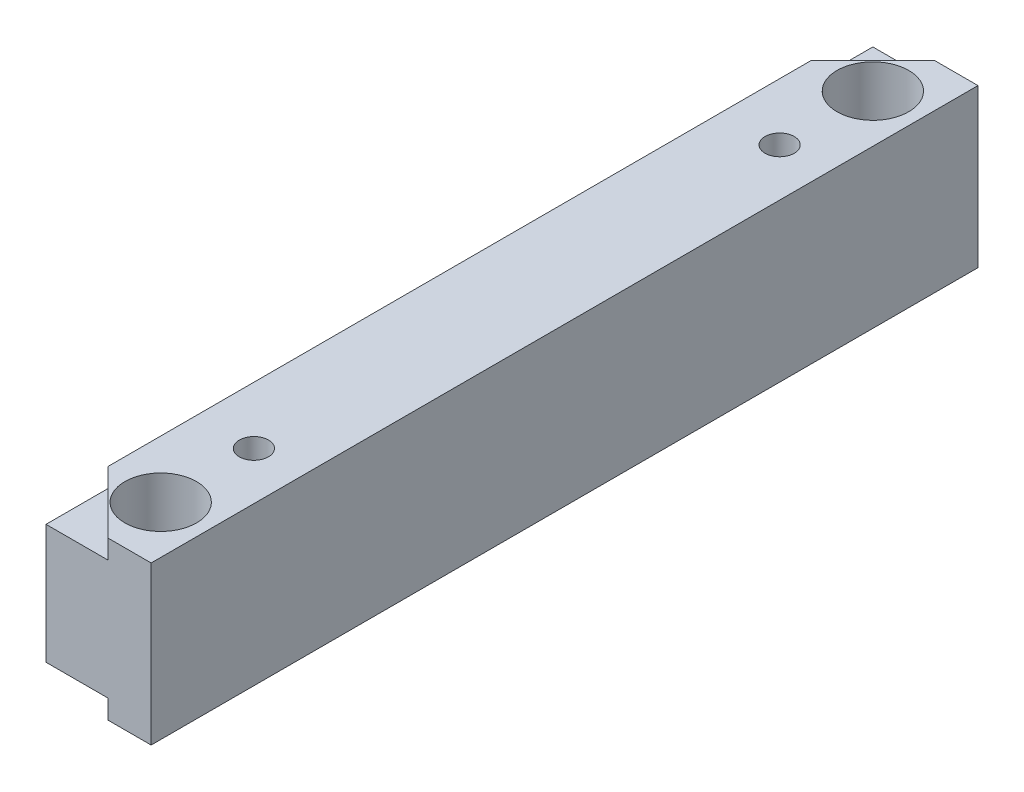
ISO-10303-21;
HEADER;
FILE_DESCRIPTION(('STEP AP214'),'2;1');
FILE_NAME('part.step','',(''),(''),'','','');
FILE_SCHEMA(('AUTOMOTIVE_DESIGN { 1 0 10303 214 1 1 1 1 }'));
ENDSEC;
DATA;
#1=APPLICATION_CONTEXT('core data for automotive mechanical design processes');
#2=APPLICATION_PROTOCOL_DEFINITION('international standard','automotive_design',2000,#1);
#3=PRODUCT_CONTEXT('',#1,'mechanical');
#4=PRODUCT('Part','Part','',(#3));
#5=PRODUCT_RELATED_PRODUCT_CATEGORY('part','',(#4));
#6=PRODUCT_DEFINITION_FORMATION('','',#4);
#7=PRODUCT_DEFINITION_CONTEXT('part definition',#1,'design');
#8=PRODUCT_DEFINITION('design','',#6,#7);
#9=PRODUCT_DEFINITION_SHAPE('','',#8);
#10=(LENGTH_UNIT() NAMED_UNIT(*) SI_UNIT(.MILLI.,.METRE.));
#11=(NAMED_UNIT(*) PLANE_ANGLE_UNIT() SI_UNIT($,.RADIAN.));
#12=(NAMED_UNIT(*) SI_UNIT($,.STERADIAN.) SOLID_ANGLE_UNIT());
#13=UNCERTAINTY_MEASURE_WITH_UNIT(LENGTH_MEASURE(1.E-05),#10,'distance_accuracy_value','');
#14=(GEOMETRIC_REPRESENTATION_CONTEXT(3) GLOBAL_UNCERTAINTY_ASSIGNED_CONTEXT((#13)) GLOBAL_UNIT_ASSIGNED_CONTEXT((#10,
#11,#12)) REPRESENTATION_CONTEXT('',''));
#15=CARTESIAN_POINT('',(0.,0.,0.));
#16=DIRECTION('',(0.,0.,1.));
#17=DIRECTION('',(1.,0.,0.));
#18=AXIS2_PLACEMENT_3D('',#15,#16,#17);
#19=CARTESIAN_POINT('',(-96.844,-74.,-81.844));
#20=DIRECTION('',(0.,1.,0.));
#21=DIRECTION('',(0.,0.,-1.));
#22=AXIS2_PLACEMENT_3D('',#19,#20,#21);
#23=PLANE('',#22);
#24=DIRECTION('',(0.,0.,-1.));
#25=VECTOR('',#24,1.);
#26=CARTESIAN_POINT('',(-123.,-73.999999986,65.));
#27=LINE('',#26,#25);
#28=CARTESIAN_POINT('',(-123.,-73.9999999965,-81.99999997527));
#29=VERTEX_POINT('',#28);
#30=CARTESIAN_POINT('',(-123.,-73.999999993,-108.));
#31=VERTEX_POINT('',#30);
#32=EDGE_CURVE('E136',#29,#31,#27,.T.);
#33=ORIENTED_EDGE('',*,*,#32,.F.);
#34=DIRECTION('',(-0.707106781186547,0.,0.707106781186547));
#35=VECTOR('',#34,1.);
#36=CARTESIAN_POINT('',(-110.,-74.,-95.));
#37=LINE('',#36,#35);
#38=CARTESIAN_POINT('',(-97.00000000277,-73.9999999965,-108.));
#39=VERTEX_POINT('',#38);
#40=EDGE_CURVE('E123',#39,#29,#37,.T.);
#41=ORIENTED_EDGE('',*,*,#40,.F.);
#42=DIRECTION('',(1.,0.,0.));
#43=VECTOR('',#42,1.);
#44=CARTESIAN_POINT('',(-101.,-73.999999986,-108.));
#45=LINE('',#44,#43);
#46=EDGE_CURVE('E143',#31,#39,#45,.T.);
#47=ORIENTED_EDGE('',*,*,#46,.F.);
#48=EDGE_LOOP('',(#33,#41,#47));
#49=FACE_BOUND('',#48,.T.);
#50=ADVANCED_FACE('F24',(#49),#23,.T.);
#51=CARTESIAN_POINT('',(-96.844,-124.,-81.844));
#52=DIRECTION('',(0.,1.,0.));
#53=DIRECTION('',(0.,0.,-1.));
#54=AXIS2_PLACEMENT_3D('',#51,#52,#53);
#55=PLANE('',#54);
#56=DIRECTION('',(0.707106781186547,0.,-0.707106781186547));
#57=VECTOR('',#56,1.);
#58=CARTESIAN_POINT('',(-110.,-124.,-95.));
#59=LINE('',#58,#57);
#60=CARTESIAN_POINT('',(-123.,-124.000000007,-81.999999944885));
#61=VERTEX_POINT('',#60);
#62=CARTESIAN_POINT('',(-97.000000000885,-124.0000000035,-108.));
#63=VERTEX_POINT('',#62);
#64=EDGE_CURVE('E182',#61,#63,#59,.T.);
#65=ORIENTED_EDGE('',*,*,#64,.F.);
#66=DIRECTION('',(0.,0.,1.));
#67=VECTOR('',#66,1.);
#68=CARTESIAN_POINT('',(-123.,-124.000000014,65.));
#69=LINE('',#68,#67);
#70=CARTESIAN_POINT('',(-123.,-124.000000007,-108.));
#71=VERTEX_POINT('',#70);
#72=EDGE_CURVE('E144',#71,#61,#69,.T.);
#73=ORIENTED_EDGE('',*,*,#72,.F.);
#74=DIRECTION('',(-1.,0.,0.));
#75=VECTOR('',#74,1.);
#76=CARTESIAN_POINT('',(-101.,-124.000000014,-108.));
#77=LINE('',#76,#75);
#78=EDGE_CURVE('E185',#63,#71,#77,.T.);
#79=ORIENTED_EDGE('',*,*,#78,.F.);
#80=EDGE_LOOP('',(#65,#73,#79));
#81=FACE_BOUND('',#80,.T.);
#82=ADVANCED_FACE('F291',(#81),#55,.F.);
#83=CARTESIAN_POINT('',(-123.,-74.,211.844));
#84=DIRECTION('',(0.,1.,0.));
#85=DIRECTION('',(0.,0.,1.));
#86=AXIS2_PLACEMENT_3D('',#83,#84,#85);
#87=PLANE('',#86);
#88=DIRECTION('',(0.707106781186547,0.,0.707106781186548));
#89=VECTOR('',#88,1.);
#90=CARTESIAN_POINT('',(-110.,-74.,225.));
#91=LINE('',#90,#89);
#92=CARTESIAN_POINT('',(-123.,-73.9999999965,211.99999997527));
#93=VERTEX_POINT('',#92);
#94=CARTESIAN_POINT('',(-97.000000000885,-73.9999999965,238.));
#95=VERTEX_POINT('',#94);
#96=EDGE_CURVE('E132',#93,#95,#91,.T.);
#97=ORIENTED_EDGE('',*,*,#96,.F.);
#98=DIRECTION('',(0.,0.,-1.));
#99=VECTOR('',#98,1.);
#100=CARTESIAN_POINT('',(-123.,-73.999999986,65.));
#101=LINE('',#100,#99);
#102=CARTESIAN_POINT('',(-123.,-73.999999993,238.));
#103=VERTEX_POINT('',#102);
#104=EDGE_CURVE('E117',#103,#93,#101,.T.);
#105=ORIENTED_EDGE('',*,*,#104,.F.);
#106=DIRECTION('',(-1.,0.,0.));
#107=VECTOR('',#106,1.);
#108=CARTESIAN_POINT('',(-101.,-73.999999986,238.));
#109=LINE('',#108,#107);
#110=EDGE_CURVE('E163',#95,#103,#109,.T.);
#111=ORIENTED_EDGE('',*,*,#110,.F.);
#112=EDGE_LOOP('',(#97,#105,#111));
#113=FACE_BOUND('',#112,.T.);
#114=ADVANCED_FACE('F294',(#113),#87,.T.);
#115=CARTESIAN_POINT('',(-123.,-124.,211.844));
#116=DIRECTION('',(0.,1.,0.));
#117=DIRECTION('',(0.,0.,1.));
#118=AXIS2_PLACEMENT_3D('',#115,#116,#117);
#119=PLANE('',#118);
#120=DIRECTION('',(0.,0.,1.));
#121=VECTOR('',#120,1.);
#122=CARTESIAN_POINT('',(-123.,-124.000000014,65.));
#123=LINE('',#122,#121);
#124=CARTESIAN_POINT('',(-123.,-124.0000000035,211.99999997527));
#125=VERTEX_POINT('',#124);
#126=CARTESIAN_POINT('',(-123.,-124.000000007,238.));
#127=VERTEX_POINT('',#126);
#128=EDGE_CURVE('E146',#125,#127,#123,.T.);
#129=ORIENTED_EDGE('',*,*,#128,.F.);
#130=DIRECTION('',(-0.707106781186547,0.,-0.707106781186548));
#131=VECTOR('',#130,1.);
#132=CARTESIAN_POINT('',(-110.,-124.,225.));
#133=LINE('',#132,#131);
#134=CARTESIAN_POINT('',(-96.999999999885,-124.000000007,238.));
#135=VERTEX_POINT('',#134);
#136=EDGE_CURVE('E83',#135,#125,#133,.T.);
#137=ORIENTED_EDGE('',*,*,#136,.F.);
#138=DIRECTION('',(1.,0.,0.));
#139=VECTOR('',#138,1.);
#140=CARTESIAN_POINT('',(-101.,-124.000000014,238.));
#141=LINE('',#140,#139);
#142=EDGE_CURVE('E225',#127,#135,#141,.T.);
#143=ORIENTED_EDGE('',*,*,#142,.F.);
#144=EDGE_LOOP('',(#129,#137,#143));
#145=FACE_BOUND('',#144,.T.);
#146=ADVANCED_FACE('F244',(#145),#119,.F.);
#147=CARTESIAN_POINT('',(-97.,-74.,-108.));
#148=DIRECTION('',(-0.707106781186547,0.,-0.707106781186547));
#149=DIRECTION('',(-0.707106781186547,0.,0.707106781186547));
#150=AXIS2_PLACEMENT_3D('',#147,#148,#149);
#151=PLANE('',#150);
#152=DIRECTION('',(-0.707106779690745,0.,0.70710678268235));
#153=VECTOR('',#152,1.);
#154=CARTESIAN_POINT('',(-96.999999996,-66.,-108.));
#155=LINE('',#154,#153);
#156=CARTESIAN_POINT('',(-96.999999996,-66.,-108.));
#157=VERTEX_POINT('',#156);
#158=CARTESIAN_POINT('',(-123.,-66.,-81.999999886));
#159=VERTEX_POINT('',#158);
#160=EDGE_CURVE('E28',#157,#159,#155,.T.);
#161=ORIENTED_EDGE('',*,*,#160,.F.);
#162=DIRECTION('',(0.,1.,0.));
#163=VECTOR('',#162,1.);
#164=CARTESIAN_POINT('',(-96.999999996,-99.,-108.));
#165=LINE('',#164,#163);
#166=EDGE_CURVE('E74',#39,#157,#165,.T.);
#167=ORIENTED_EDGE('',*,*,#166,.F.);
#168=ORIENTED_EDGE('',*,*,#40,.T.);
#169=DIRECTION('',(0.,-1.,0.));
#170=VECTOR('',#169,1.);
#171=CARTESIAN_POINT('',(-123.,-99.,-81.999999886));
#172=LINE('',#171,#170);
#173=EDGE_CURVE('E127',#159,#29,#172,.T.);
#174=ORIENTED_EDGE('',*,*,#173,.F.);
#175=EDGE_LOOP('',(#161,#167,#168,#174));
#176=FACE_BOUND('',#175,.T.);
#177=ADVANCED_FACE('F126',(#176),#151,.T.);
#178=CARTESIAN_POINT('',(-97.,-66.,238.));
#179=DIRECTION('',(-0.707106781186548,0.,0.707106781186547));
#180=DIRECTION('',(-0.707106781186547,0.,-0.707106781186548));
#181=AXIS2_PLACEMENT_3D('',#178,#179,#180);
#182=PLANE('',#181);
#183=DIRECTION('',(0.707106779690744,0.,0.707106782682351));
#184=VECTOR('',#183,1.);
#185=CARTESIAN_POINT('',(-123.,-66.,211.999999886));
#186=LINE('',#185,#184);
#187=CARTESIAN_POINT('',(-123.,-66.,211.999999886));
#188=VERTEX_POINT('',#187);
#189=CARTESIAN_POINT('',(-96.999999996,-66.,238.));
#190=VERTEX_POINT('',#189);
#191=EDGE_CURVE('E158',#188,#190,#186,.T.);
#192=ORIENTED_EDGE('',*,*,#191,.F.);
#193=DIRECTION('',(0.,1.,0.));
#194=VECTOR('',#193,1.);
#195=CARTESIAN_POINT('',(-123.,-99.,211.999999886));
#196=LINE('',#195,#194);
#197=EDGE_CURVE('E141',#93,#188,#196,.T.);
#198=ORIENTED_EDGE('',*,*,#197,.F.);
#199=ORIENTED_EDGE('',*,*,#96,.T.);
#200=DIRECTION('',(0.,-1.,0.));
#201=VECTOR('',#200,1.);
#202=CARTESIAN_POINT('',(-96.999999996,-99.,238.));
#203=LINE('',#202,#201);
#204=EDGE_CURVE('E160',#190,#95,#203,.T.);
#205=ORIENTED_EDGE('',*,*,#204,.F.);
#206=EDGE_LOOP('',(#192,#198,#199,#205));
#207=FACE_BOUND('',#206,.T.);
#208=ADVANCED_FACE('F217',(#207),#182,.T.);
#209=CARTESIAN_POINT('',(-123.,-132.,238.));
#210=DIRECTION('',(-1.,0.,0.));
#211=DIRECTION('',(0.,1.,0.));
#212=AXIS2_PLACEMENT_3D('',#209,#210,#211);
#213=PLANE('',#212);
#214=DIRECTION('',(0.,0.,1.));
#215=VECTOR('',#214,1.);
#216=CARTESIAN_POINT('',(-123.,-66.,65.));
#217=LINE('',#216,#215);
#218=EDGE_CURVE('E139',#159,#188,#217,.T.);
#219=ORIENTED_EDGE('',*,*,#218,.F.);
#220=ORIENTED_EDGE('',*,*,#173,.T.);
#221=ORIENTED_EDGE('',*,*,#32,.T.);
#222=DIRECTION('',(0.,1.,0.));
#223=VECTOR('',#222,1.);
#224=CARTESIAN_POINT('',(-123.,-99.,-108.));
#225=LINE('',#224,#223);
#226=EDGE_CURVE('E234',#71,#31,#225,.T.);
#227=ORIENTED_EDGE('',*,*,#226,.F.);
#228=ORIENTED_EDGE('',*,*,#72,.T.);
#229=DIRECTION('',(0.,1.,0.));
#230=VECTOR('',#229,1.);
#231=CARTESIAN_POINT('',(-123.,-128.,-82.));
#232=LINE('',#231,#230);
#233=CARTESIAN_POINT('',(-123.,-132.,-81.999999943));
#234=VERTEX_POINT('',#233);
#235=EDGE_CURVE('E140',#234,#61,#232,.T.);
#236=ORIENTED_EDGE('',*,*,#235,.F.);
#237=DIRECTION('',(0.,0.,-1.));
#238=VECTOR('',#237,1.);
#239=CARTESIAN_POINT('',(-123.,-132.,65.));
#240=LINE('',#239,#238);
#241=CARTESIAN_POINT('',(-123.,-132.,211.999999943));
#242=VERTEX_POINT('',#241);
#243=EDGE_CURVE('E176',#242,#234,#240,.T.);
#244=ORIENTED_EDGE('',*,*,#243,.F.);
#245=DIRECTION('',(0.,-1.,0.));
#246=VECTOR('',#245,1.);
#247=CARTESIAN_POINT('',(-123.,-128.,212.));
#248=LINE('',#247,#246);
#249=EDGE_CURVE('E174',#125,#242,#248,.T.);
#250=ORIENTED_EDGE('',*,*,#249,.F.);
#251=ORIENTED_EDGE('',*,*,#128,.T.);
#252=DIRECTION('',(0.,-1.,0.));
#253=VECTOR('',#252,1.);
#254=CARTESIAN_POINT('',(-123.,-99.,238.));
#255=LINE('',#254,#253);
#256=EDGE_CURVE('E173',#103,#127,#255,.T.);
#257=ORIENTED_EDGE('',*,*,#256,.F.);
#258=ORIENTED_EDGE('',*,*,#104,.T.);
#259=ORIENTED_EDGE('',*,*,#197,.T.);
#260=EDGE_LOOP('',(#219,#220,#221,#227,#228,#236,#244,#250,#251,#257,#258,#259));
#261=FACE_BOUND('',#260,.T.);
#262=ADVANCED_FACE('F134',(#261),#213,.T.);
#263=CARTESIAN_POINT('',(-97.,-132.,-108.));
#264=DIRECTION('',(-0.707106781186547,0.,-0.707106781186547));
#265=DIRECTION('',(-0.707106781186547,0.,0.707106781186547));
#266=AXIS2_PLACEMENT_3D('',#263,#264,#265);
#267=PLANE('',#266);
#268=ORIENTED_EDGE('',*,*,#64,.T.);
#269=DIRECTION('',(0.,1.,0.));
#270=VECTOR('',#269,1.);
#271=CARTESIAN_POINT('',(-96.999999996,-99.,-108.));
#272=LINE('',#271,#270);
#273=CARTESIAN_POINT('',(-96.999999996,-132.,-108.));
#274=VERTEX_POINT('',#273);
#275=EDGE_CURVE('E152',#274,#63,#272,.T.);
#276=ORIENTED_EDGE('',*,*,#275,.F.);
#277=DIRECTION('',(0.707106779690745,0.,-0.70710678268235));
#278=VECTOR('',#277,1.);
#279=CARTESIAN_POINT('',(-123.,-132.,-81.999999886));
#280=LINE('',#279,#278);
#281=EDGE_CURVE('E178',#234,#274,#280,.T.);
#282=ORIENTED_EDGE('',*,*,#281,.F.);
#283=ORIENTED_EDGE('',*,*,#235,.T.);
#284=EDGE_LOOP('',(#268,#276,#282,#283));
#285=FACE_BOUND('',#284,.T.);
#286=ADVANCED_FACE('F256',(#285),#267,.T.);
#287=CARTESIAN_POINT('',(-123.,-132.,-108.));
#288=DIRECTION('',(0.,0.,-1.));
#289=DIRECTION('',(0.,1.,0.));
#290=AXIS2_PLACEMENT_3D('',#287,#288,#289);
#291=PLANE('',#290);
#292=ORIENTED_EDGE('',*,*,#78,.T.);
#293=ORIENTED_EDGE('',*,*,#226,.T.);
#294=ORIENTED_EDGE('',*,*,#46,.T.);
#295=ORIENTED_EDGE('',*,*,#166,.T.);
#296=DIRECTION('',(-1.,0.,0.));
#297=VECTOR('',#296,1.);
#298=CARTESIAN_POINT('',(-101.,-66.,-108.));
#299=LINE('',#298,#297);
#300=CARTESIAN_POINT('',(-79.,-66.,-108.));
#301=VERTEX_POINT('',#300);
#302=EDGE_CURVE('E153',#301,#157,#299,.T.);
#303=ORIENTED_EDGE('',*,*,#302,.F.);
#304=DIRECTION('',(0.,1.,0.));
#305=VECTOR('',#304,1.);
#306=CARTESIAN_POINT('',(-79.,-99.,-108.));
#307=LINE('',#306,#305);
#308=CARTESIAN_POINT('',(-79.,-132.,-108.));
#309=VERTEX_POINT('',#308);
#310=EDGE_CURVE('E227',#309,#301,#307,.T.);
#311=ORIENTED_EDGE('',*,*,#310,.F.);
#312=DIRECTION('',(1.,0.,0.));
#313=VECTOR('',#312,1.);
#314=CARTESIAN_POINT('',(-101.,-132.,-108.));
#315=LINE('',#314,#313);
#316=EDGE_CURVE('E186',#274,#309,#315,.T.);
#317=ORIENTED_EDGE('',*,*,#316,.F.);
#318=ORIENTED_EDGE('',*,*,#275,.T.);
#319=EDGE_LOOP('',(#292,#293,#294,#295,#303,#311,#317,#318));
#320=FACE_BOUND('',#319,.T.);
#321=ADVANCED_FACE('F252',(#320),#291,.T.);
#322=CARTESIAN_POINT('',(-79.,-66.,238.));
#323=DIRECTION('',(1.,0.,0.));
#324=DIRECTION('',(0.,-1.,0.));
#325=AXIS2_PLACEMENT_3D('',#322,#323,#324);
#326=PLANE('',#325);
#327=DIRECTION('',(0.,0.,1.));
#328=VECTOR('',#327,1.);
#329=CARTESIAN_POINT('',(-79.,-132.,65.));
#330=LINE('',#329,#328);
#331=CARTESIAN_POINT('',(-79.,-132.,238.));
#332=VERTEX_POINT('',#331);
#333=EDGE_CURVE('E170',#309,#332,#330,.T.);
#334=ORIENTED_EDGE('',*,*,#333,.F.);
#335=ORIENTED_EDGE('',*,*,#310,.T.);
#336=DIRECTION('',(0.,0.,-1.));
#337=VECTOR('',#336,1.);
#338=CARTESIAN_POINT('',(-79.,-66.,65.));
#339=LINE('',#338,#337);
#340=CARTESIAN_POINT('',(-79.,-66.,238.));
#341=VERTEX_POINT('',#340);
#342=EDGE_CURVE('E155',#341,#301,#339,.T.);
#343=ORIENTED_EDGE('',*,*,#342,.F.);
#344=DIRECTION('',(0.,1.,0.));
#345=VECTOR('',#344,1.);
#346=CARTESIAN_POINT('',(-79.,-99.,238.));
#347=LINE('',#346,#345);
#348=EDGE_CURVE('E164',#332,#341,#347,.T.);
#349=ORIENTED_EDGE('',*,*,#348,.F.);
#350=EDGE_LOOP('',(#334,#335,#343,#349));
#351=FACE_BOUND('',#350,.T.);
#352=ADVANCED_FACE('F250',(#351),#326,.T.);
#353=CARTESIAN_POINT('',(-123.,-66.,238.));
#354=DIRECTION('',(0.,0.,1.));
#355=DIRECTION('',(0.,-1.,0.));
#356=AXIS2_PLACEMENT_3D('',#353,#354,#355);
#357=PLANE('',#356);
#358=ORIENTED_EDGE('',*,*,#110,.T.);
#359=ORIENTED_EDGE('',*,*,#256,.T.);
#360=ORIENTED_EDGE('',*,*,#142,.T.);
#361=DIRECTION('',(0.,1.,0.));
#362=VECTOR('',#361,1.);
#363=CARTESIAN_POINT('',(-97.,-128.,238.));
#364=LINE('',#363,#362);
#365=CARTESIAN_POINT('',(-96.999999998,-132.,238.));
#366=VERTEX_POINT('',#365);
#367=EDGE_CURVE('E171',#366,#135,#364,.T.);
#368=ORIENTED_EDGE('',*,*,#367,.F.);
#369=DIRECTION('',(-1.,0.,0.));
#370=VECTOR('',#369,1.);
#371=CARTESIAN_POINT('',(-101.,-132.,238.));
#372=LINE('',#371,#370);
#373=EDGE_CURVE('E43',#332,#366,#372,.T.);
#374=ORIENTED_EDGE('',*,*,#373,.F.);
#375=ORIENTED_EDGE('',*,*,#348,.T.);
#376=DIRECTION('',(1.,0.,0.));
#377=VECTOR('',#376,1.);
#378=CARTESIAN_POINT('',(-101.,-66.,238.));
#379=LINE('',#378,#377);
#380=EDGE_CURVE('E165',#190,#341,#379,.T.);
#381=ORIENTED_EDGE('',*,*,#380,.F.);
#382=ORIENTED_EDGE('',*,*,#204,.T.);
#383=EDGE_LOOP('',(#358,#359,#360,#368,#374,#375,#381,#382));
#384=FACE_BOUND('',#383,.T.);
#385=ADVANCED_FACE('F221',(#384),#357,.T.);
#386=CARTESIAN_POINT('',(-97.,-124.,238.));
#387=DIRECTION('',(-0.707106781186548,0.,0.707106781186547));
#388=DIRECTION('',(-0.707106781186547,0.,-0.707106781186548));
#389=AXIS2_PLACEMENT_3D('',#386,#387,#388);
#390=PLANE('',#389);
#391=ORIENTED_EDGE('',*,*,#136,.T.);
#392=ORIENTED_EDGE('',*,*,#249,.T.);
#393=DIRECTION('',(-0.707106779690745,0.,-0.70710678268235));
#394=VECTOR('',#393,1.);
#395=CARTESIAN_POINT('',(-96.999999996,-132.,238.));
#396=LINE('',#395,#394);
#397=EDGE_CURVE('E169',#366,#242,#396,.T.);
#398=ORIENTED_EDGE('',*,*,#397,.F.);
#399=ORIENTED_EDGE('',*,*,#367,.T.);
#400=EDGE_LOOP('',(#391,#392,#398,#399));
#401=FACE_BOUND('',#400,.T.);
#402=ADVANCED_FACE('F287',(#401),#390,.T.);
#403=CARTESIAN_POINT('',(-99.,-132.,214.));
#404=DIRECTION('',(0.,1.,0.));
#405=DIRECTION('',(0.,0.,1.));
#406=AXIS2_PLACEMENT_3D('',#403,#404,#405);
#407=CYLINDRICAL_SURFACE('',#406,15.);
#408=CARTESIAN_POINT('',(-99.,-132.,214.));
#409=DIRECTION('',(0.,1.,0.));
#410=DIRECTION('',(0.,0.,1.));
#411=AXIS2_PLACEMENT_3D('',#408,#409,#410);
#412=CIRCLE('',#411,15.);
#413=CARTESIAN_POINT('',(-99.,-132.,229.));
#414=VERTEX_POINT('',#413);
#415=EDGE_CURVE('E197',#414,#414,#412,.T.);
#416=ORIENTED_EDGE('',*,*,#415,.F.);
#417=EDGE_LOOP('',(#416));
#418=FACE_BOUND('',#417,.T.);
#419=CARTESIAN_POINT('',(-99.,-66.,214.));
#420=DIRECTION('',(0.,1.,0.));
#421=DIRECTION('',(0.,0.,1.));
#422=AXIS2_PLACEMENT_3D('',#419,#420,#421);
#423=CIRCLE('',#422,15.);
#424=CARTESIAN_POINT('',(-99.,-66.,229.));
#425=VERTEX_POINT('',#424);
#426=EDGE_CURVE('E154',#425,#425,#423,.F.);
#427=ORIENTED_EDGE('',*,*,#426,.F.);
#428=EDGE_LOOP('',(#427));
#429=FACE_BOUND('',#428,.T.);
#430=ADVANCED_FACE('F283',(#418,#429),#407,.F.);
#431=CARTESIAN_POINT('',(-99.,-66.,-45.));
#432=DIRECTION('',(0.,-1.,0.));
#433=DIRECTION('',(0.,0.,-1.));
#434=AXIS2_PLACEMENT_3D('',#431,#432,#433);
#435=CYLINDRICAL_SURFACE('',#434,6.09999999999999);
#436=CARTESIAN_POINT('',(-99.,-132.,-45.));
#437=DIRECTION('',(0.,-1.,0.));
#438=DIRECTION('',(0.,0.,-1.));
#439=AXIS2_PLACEMENT_3D('',#436,#437,#438);
#440=CIRCLE('',#439,6.09999999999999);
#441=CARTESIAN_POINT('',(-99.,-132.,-51.1));
#442=VERTEX_POINT('',#441);
#443=EDGE_CURVE('E194',#442,#442,#440,.F.);
#444=ORIENTED_EDGE('',*,*,#443,.F.);
#445=EDGE_LOOP('',(#444));
#446=FACE_BOUND('',#445,.T.);
#447=CARTESIAN_POINT('',(-99.,-66.,-45.));
#448=DIRECTION('',(0.,-1.,0.));
#449=DIRECTION('',(0.,0.,-1.));
#450=AXIS2_PLACEMENT_3D('',#447,#448,#449);
#451=CIRCLE('',#450,6.09999999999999);
#452=CARTESIAN_POINT('',(-99.,-66.,-51.1));
#453=VERTEX_POINT('',#452);
#454=EDGE_CURVE('E204',#453,#453,#451,.T.);
#455=ORIENTED_EDGE('',*,*,#454,.F.);
#456=EDGE_LOOP('',(#455));
#457=FACE_BOUND('',#456,.T.);
#458=ADVANCED_FACE('F279',(#446,#457),#435,.F.);
#459=CARTESIAN_POINT('',(-99.,-132.,-84.));
#460=DIRECTION('',(0.,1.,0.));
#461=DIRECTION('',(0.,0.,1.));
#462=AXIS2_PLACEMENT_3D('',#459,#460,#461);
#463=CYLINDRICAL_SURFACE('',#462,15.);
#464=CARTESIAN_POINT('',(-99.,-132.,-84.));
#465=DIRECTION('',(0.,1.,0.));
#466=DIRECTION('',(0.,0.,1.));
#467=AXIS2_PLACEMENT_3D('',#464,#465,#466);
#468=CIRCLE('',#467,15.);
#469=CARTESIAN_POINT('',(-99.,-132.,-69.));
#470=VERTEX_POINT('',#469);
#471=EDGE_CURVE('E191',#470,#470,#468,.T.);
#472=ORIENTED_EDGE('',*,*,#471,.F.);
#473=EDGE_LOOP('',(#472));
#474=FACE_BOUND('',#473,.T.);
#475=CARTESIAN_POINT('',(-99.,-66.,-84.));
#476=DIRECTION('',(0.,1.,0.));
#477=DIRECTION('',(0.,0.,1.));
#478=AXIS2_PLACEMENT_3D('',#475,#476,#477);
#479=CIRCLE('',#478,15.);
#480=CARTESIAN_POINT('',(-99.,-66.,-69.));
#481=VERTEX_POINT('',#480);
#482=EDGE_CURVE('E179',#481,#481,#479,.F.);
#483=ORIENTED_EDGE('',*,*,#482,.F.);
#484=EDGE_LOOP('',(#483));
#485=FACE_BOUND('',#484,.T.);
#486=ADVANCED_FACE('F276',(#474,#485),#463,.F.);
#487=CARTESIAN_POINT('',(-123.,-66.,238.));
#488=DIRECTION('',(0.,1.,0.));
#489=DIRECTION('',(1.,0.,0.));
#490=AXIS2_PLACEMENT_3D('',#487,#488,#489);
#491=PLANE('',#490);
#492=ORIENTED_EDGE('',*,*,#482,.T.);
#493=EDGE_LOOP('',(#492));
#494=FACE_BOUND('',#493,.T.);
#495=ORIENTED_EDGE('',*,*,#454,.T.);
#496=EDGE_LOOP('',(#495));
#497=FACE_BOUND('',#496,.T.);
#498=ORIENTED_EDGE('',*,*,#426,.T.);
#499=EDGE_LOOP('',(#498));
#500=FACE_BOUND('',#499,.T.);
#501=CARTESIAN_POINT('',(-99.,-66.,175.));
#502=DIRECTION('',(0.,-1.,0.));
#503=DIRECTION('',(0.,0.,-1.));
#504=AXIS2_PLACEMENT_3D('',#501,#502,#503);
#505=CIRCLE('',#504,6.09999999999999);
#506=CARTESIAN_POINT('',(-99.,-66.,168.9));
#507=VERTEX_POINT('',#506);
#508=EDGE_CURVE('E34',#507,#507,#505,.F.);
#509=ORIENTED_EDGE('',*,*,#508,.F.);
#510=EDGE_LOOP('',(#509));
#511=FACE_BOUND('',#510,.T.);
#512=ORIENTED_EDGE('',*,*,#342,.T.);
#513=ORIENTED_EDGE('',*,*,#302,.T.);
#514=ORIENTED_EDGE('',*,*,#160,.T.);
#515=ORIENTED_EDGE('',*,*,#218,.T.);
#516=ORIENTED_EDGE('',*,*,#191,.T.);
#517=ORIENTED_EDGE('',*,*,#380,.T.);
#518=EDGE_LOOP('',(#512,#513,#514,#515,#516,#517));
#519=FACE_BOUND('',#518,.T.);
#520=ADVANCED_FACE('F212',(#494,#497,#500,#511,#519),#491,.T.);
#521=CARTESIAN_POINT('',(-79.,-132.,238.));
#522=DIRECTION('',(0.,-1.,0.));
#523=DIRECTION('',(-1.,0.,0.));
#524=AXIS2_PLACEMENT_3D('',#521,#522,#523);
#525=PLANE('',#524);
#526=ORIENTED_EDGE('',*,*,#471,.T.);
#527=EDGE_LOOP('',(#526));
#528=FACE_BOUND('',#527,.T.);
#529=ORIENTED_EDGE('',*,*,#443,.T.);
#530=EDGE_LOOP('',(#529));
#531=FACE_BOUND('',#530,.T.);
#532=CARTESIAN_POINT('',(-99.,-132.,175.));
#533=DIRECTION('',(0.,-1.,0.));
#534=DIRECTION('',(0.,0.,-1.));
#535=AXIS2_PLACEMENT_3D('',#532,#533,#534);
#536=CIRCLE('',#535,6.09999999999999);
#537=CARTESIAN_POINT('',(-99.,-132.,168.9));
#538=VERTEX_POINT('',#537);
#539=EDGE_CURVE('E13',#538,#538,#536,.T.);
#540=ORIENTED_EDGE('',*,*,#539,.F.);
#541=EDGE_LOOP('',(#540));
#542=FACE_BOUND('',#541,.T.);
#543=ORIENTED_EDGE('',*,*,#415,.T.);
#544=EDGE_LOOP('',(#543));
#545=FACE_BOUND('',#544,.T.);
#546=ORIENTED_EDGE('',*,*,#373,.T.);
#547=ORIENTED_EDGE('',*,*,#397,.T.);
#548=ORIENTED_EDGE('',*,*,#243,.T.);
#549=ORIENTED_EDGE('',*,*,#281,.T.);
#550=ORIENTED_EDGE('',*,*,#316,.T.);
#551=ORIENTED_EDGE('',*,*,#333,.T.);
#552=EDGE_LOOP('',(#546,#547,#548,#549,#550,#551));
#553=FACE_BOUND('',#552,.T.);
#554=ADVANCED_FACE('F26',(#528,#531,#542,#545,#553),#525,.T.);
#555=CARTESIAN_POINT('',(-99.,-66.,175.));
#556=DIRECTION('',(0.,-1.,0.));
#557=DIRECTION('',(0.,0.,-1.));
#558=AXIS2_PLACEMENT_3D('',#555,#556,#557);
#559=CYLINDRICAL_SURFACE('',#558,6.09999999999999);
#560=ORIENTED_EDGE('',*,*,#539,.T.);
#561=EDGE_LOOP('',(#560));
#562=FACE_BOUND('',#561,.T.);
#563=ORIENTED_EDGE('',*,*,#508,.T.);
#564=EDGE_LOOP('',(#563));
#565=FACE_BOUND('',#564,.T.);
#566=ADVANCED_FACE('F266',(#562,#565),#559,.F.);
#567=CLOSED_SHELL('',(#50,#82,#114,#146,#177,#208,#262,#286,#321,#352,#385,#402,#430,#458,#486,
#520,#554,#566));
#568=MANIFOLD_SOLID_BREP('B1',#567);
#569=ADVANCED_BREP_SHAPE_REPRESENTATION('',(#18,#568),#14);
#570=SHAPE_DEFINITION_REPRESENTATION(#9,#569);
ENDSEC;
END-ISO-10303-21;
